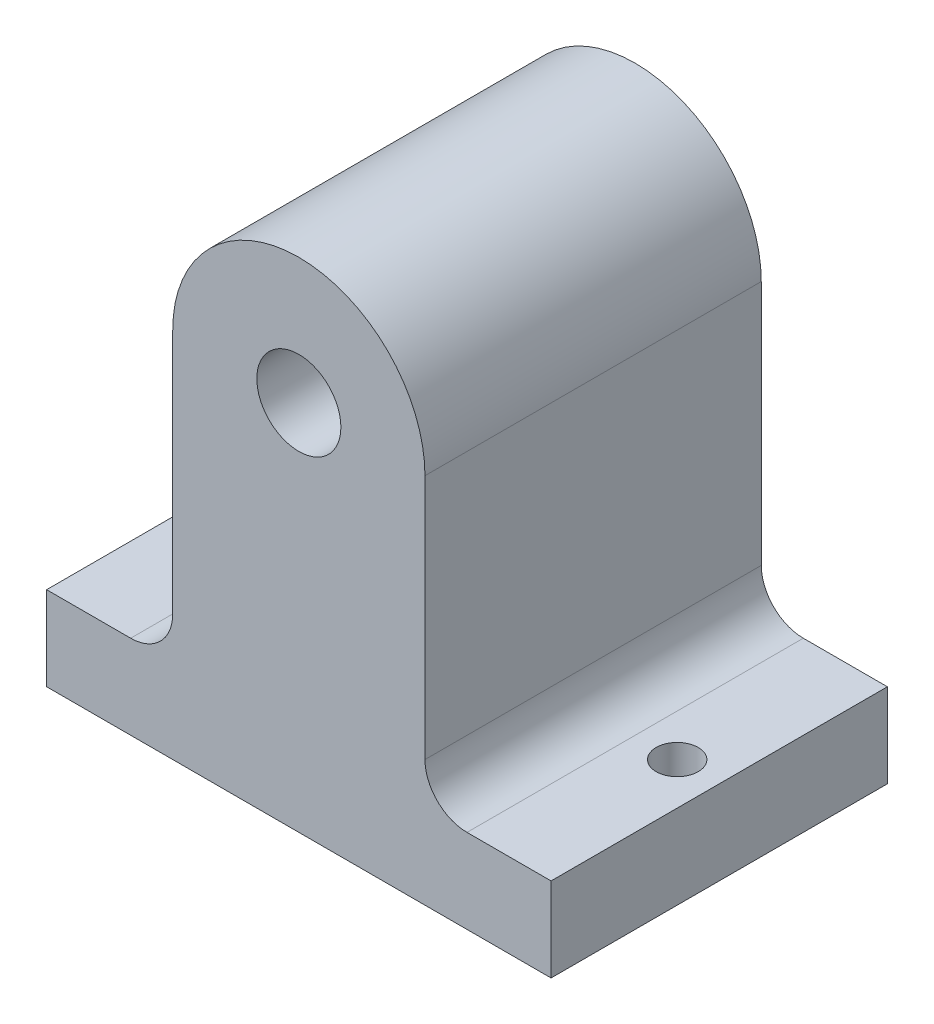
ISO-10303-21;
HEADER;
FILE_DESCRIPTION(('STEP AP214'),'2;1');
FILE_NAME('part.step','',(''),(''),'','','');
FILE_SCHEMA(('AUTOMOTIVE_DESIGN { 1 0 10303 214 1 1 1 1 }'));
ENDSEC;
DATA;
#1=APPLICATION_CONTEXT('core data for automotive mechanical design processes');
#2=APPLICATION_PROTOCOL_DEFINITION('international standard','automotive_design',2000,#1);
#3=PRODUCT_CONTEXT('',#1,'mechanical');
#4=PRODUCT('Part','Part','',(#3));
#5=PRODUCT_RELATED_PRODUCT_CATEGORY('part','',(#4));
#6=PRODUCT_DEFINITION_FORMATION('','',#4);
#7=PRODUCT_DEFINITION_CONTEXT('part definition',#1,'design');
#8=PRODUCT_DEFINITION('design','',#6,#7);
#9=PRODUCT_DEFINITION_SHAPE('','',#8);
#10=(LENGTH_UNIT() NAMED_UNIT(*) SI_UNIT(.MILLI.,.METRE.));
#11=(NAMED_UNIT(*) PLANE_ANGLE_UNIT() SI_UNIT($,.RADIAN.));
#12=(NAMED_UNIT(*) SI_UNIT($,.STERADIAN.) SOLID_ANGLE_UNIT());
#13=UNCERTAINTY_MEASURE_WITH_UNIT(LENGTH_MEASURE(1.E-05),#10,'distance_accuracy_value','');
#14=(GEOMETRIC_REPRESENTATION_CONTEXT(3) GLOBAL_UNCERTAINTY_ASSIGNED_CONTEXT((#13)) GLOBAL_UNIT_ASSIGNED_CONTEXT((#10,
#11,#12)) REPRESENTATION_CONTEXT('',''));
#15=CARTESIAN_POINT('',(0.,0.,0.));
#16=DIRECTION('',(0.,0.,1.));
#17=DIRECTION('',(1.,0.,0.));
#18=AXIS2_PLACEMENT_3D('',#15,#16,#17);
#19=CARTESIAN_POINT('',(0.,0.,25.4));
#20=DIRECTION('',(0.,0.,-1.));
#21=DIRECTION('',(-1.,0.,0.));
#22=AXIS2_PLACEMENT_3D('',#19,#20,#21);
#23=CYLINDRICAL_SURFACE('',#22,9.525);
#24=CARTESIAN_POINT('',(0.,0.,0.));
#25=DIRECTION('',(0.,0.,1.));
#26=DIRECTION('',(1.,0.,0.));
#27=AXIS2_PLACEMENT_3D('',#24,#25,#26);
#28=CIRCLE('',#27,9.525);
#29=CARTESIAN_POINT('',(9.525,0.,0.));
#30=VERTEX_POINT('',#29);
#31=CARTESIAN_POINT('',(-9.525,0.,0.));
#32=VERTEX_POINT('',#31);
#33=EDGE_CURVE('E127',#30,#32,#28,.T.);
#34=ORIENTED_EDGE('',*,*,#33,.T.);
#35=DIRECTION('',(0.,0.,-1.));
#36=VECTOR('',#35,1.);
#37=CARTESIAN_POINT('',(-9.525,0.,25.4));
#38=LINE('',#37,#36);
#39=CARTESIAN_POINT('',(-9.525,0.,25.4));
#40=VERTEX_POINT('',#39);
#41=EDGE_CURVE('E110',#40,#32,#38,.T.);
#42=ORIENTED_EDGE('',*,*,#41,.F.);
#43=CARTESIAN_POINT('',(0.,0.,25.4));
#44=DIRECTION('',(0.,0.,1.));
#45=DIRECTION('',(1.,0.,0.));
#46=AXIS2_PLACEMENT_3D('',#43,#44,#45);
#47=CIRCLE('',#46,9.525);
#48=CARTESIAN_POINT('',(9.525,0.,25.4));
#49=VERTEX_POINT('',#48);
#50=EDGE_CURVE('E115',#49,#40,#47,.T.);
#51=ORIENTED_EDGE('',*,*,#50,.F.);
#52=DIRECTION('',(0.,0.,-1.));
#53=VECTOR('',#52,1.);
#54=CARTESIAN_POINT('',(9.525,0.,25.4));
#55=LINE('',#54,#53);
#56=EDGE_CURVE('E157',#49,#30,#55,.T.);
#57=ORIENTED_EDGE('',*,*,#56,.T.);
#58=EDGE_LOOP('',(#34,#42,#51,#57));
#59=FACE_BOUND('',#58,.T.);
#60=ADVANCED_FACE('F32',(#59),#23,.T.);
#61=CARTESIAN_POINT('',(-9.525,0.,25.4));
#62=DIRECTION('',(1.,0.,0.));
#63=DIRECTION('',(0.,1.,0.));
#64=AXIS2_PLACEMENT_3D('',#61,#62,#63);
#65=PLANE('',#64);
#66=DIRECTION('',(0.,-1.,0.));
#67=VECTOR('',#66,1.);
#68=CARTESIAN_POINT('',(-9.525,0.,0.));
#69=LINE('',#68,#67);
#70=CARTESIAN_POINT('',(-9.525,-18.565900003,0.));
#71=VERTEX_POINT('',#70);
#72=EDGE_CURVE('E198',#32,#71,#69,.T.);
#73=ORIENTED_EDGE('',*,*,#72,.T.);
#74=DIRECTION('',(0.,0.,-1.));
#75=VECTOR('',#74,1.);
#76=CARTESIAN_POINT('',(-9.525,-18.565900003,25.4));
#77=LINE('',#76,#75);
#78=CARTESIAN_POINT('',(-9.525,-18.565900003,25.4));
#79=VERTEX_POINT('',#78);
#80=EDGE_CURVE('E48',#71,#79,#77,.F.);
#81=ORIENTED_EDGE('',*,*,#80,.T.);
#82=DIRECTION('',(0.,-1.,0.));
#83=VECTOR('',#82,1.);
#84=CARTESIAN_POINT('',(-9.525,0.,25.4));
#85=LINE('',#84,#83);
#86=EDGE_CURVE('E106',#40,#79,#85,.T.);
#87=ORIENTED_EDGE('',*,*,#86,.F.);
#88=ORIENTED_EDGE('',*,*,#41,.T.);
#89=EDGE_LOOP('',(#73,#81,#87,#88));
#90=FACE_BOUND('',#89,.T.);
#91=ADVANCED_FACE('F108',(#90),#65,.F.);
#92=CARTESIAN_POINT('',(0.,-21.740900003,25.4));
#93=DIRECTION('',(0.,1.,0.));
#94=DIRECTION('',(0.,0.,1.));
#95=AXIS2_PLACEMENT_3D('',#92,#93,#94);
#96=PLANE('',#95);
#97=CARTESIAN_POINT('',(-15.875,-21.740900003,12.7));
#98=DIRECTION('',(0.,1.,0.));
#99=DIRECTION('',(0.,0.,1.));
#100=AXIS2_PLACEMENT_3D('',#97,#98,#99);
#101=CIRCLE('',#100,1.5875);
#102=CARTESIAN_POINT('',(-15.875,-21.740900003,14.2875));
#103=VERTEX_POINT('',#102);
#104=EDGE_CURVE('E219',#103,#103,#101,.T.);
#105=ORIENTED_EDGE('',*,*,#104,.F.);
#106=EDGE_LOOP('',(#105));
#107=FACE_BOUND('',#106,.T.);
#108=DIRECTION('',(1.,0.,0.));
#109=VECTOR('',#108,1.);
#110=CARTESIAN_POINT('',(0.,-21.740900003,25.4));
#111=LINE('',#110,#109);
#112=CARTESIAN_POINT('',(-19.05,-21.740900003,25.4));
#113=VERTEX_POINT('',#112);
#114=CARTESIAN_POINT('',(-12.7,-21.740900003,25.4));
#115=VERTEX_POINT('',#114);
#116=EDGE_CURVE('E114',#113,#115,#111,.T.);
#117=ORIENTED_EDGE('',*,*,#116,.T.);
#118=DIRECTION('',(0.,0.,-1.));
#119=VECTOR('',#118,1.);
#120=CARTESIAN_POINT('',(-12.7,-21.740900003,25.4));
#121=LINE('',#120,#119);
#122=CARTESIAN_POINT('',(-12.7,-21.740900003,0.));
#123=VERTEX_POINT('',#122);
#124=EDGE_CURVE('E139',#115,#123,#121,.T.);
#125=ORIENTED_EDGE('',*,*,#124,.T.);
#126=DIRECTION('',(1.,0.,0.));
#127=VECTOR('',#126,1.);
#128=CARTESIAN_POINT('',(0.,-21.740900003,0.));
#129=LINE('',#128,#127);
#130=CARTESIAN_POINT('',(-19.05,-21.740900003,0.));
#131=VERTEX_POINT('',#130);
#132=EDGE_CURVE('E196',#131,#123,#129,.T.);
#133=ORIENTED_EDGE('',*,*,#132,.F.);
#134=DIRECTION('',(0.,0.,-1.));
#135=VECTOR('',#134,1.);
#136=CARTESIAN_POINT('',(-19.05,-21.740900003,25.4));
#137=LINE('',#136,#135);
#138=EDGE_CURVE('E129',#113,#131,#137,.T.);
#139=ORIENTED_EDGE('',*,*,#138,.F.);
#140=EDGE_LOOP('',(#117,#125,#133,#139));
#141=FACE_BOUND('',#140,.T.);
#142=ADVANCED_FACE('F229',(#107,#141),#96,.T.);
#143=CARTESIAN_POINT('',(-19.05,0.,25.4));
#144=DIRECTION('',(-1.,0.,0.));
#145=DIRECTION('',(0.,-1.,0.));
#146=AXIS2_PLACEMENT_3D('',#143,#144,#145);
#147=PLANE('',#146);
#148=DIRECTION('',(0.,1.,0.));
#149=VECTOR('',#148,1.);
#150=CARTESIAN_POINT('',(-19.05,0.,0.));
#151=LINE('',#150,#149);
#152=CARTESIAN_POINT('',(-19.05,-28.090900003,0.));
#153=VERTEX_POINT('',#152);
#154=EDGE_CURVE('E193',#153,#131,#151,.T.);
#155=ORIENTED_EDGE('',*,*,#154,.F.);
#156=DIRECTION('',(0.,0.,-1.));
#157=VECTOR('',#156,1.);
#158=CARTESIAN_POINT('',(-19.05,-28.090900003,25.4));
#159=LINE('',#158,#157);
#160=CARTESIAN_POINT('',(-19.05,-28.090900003,25.4));
#161=VERTEX_POINT('',#160);
#162=EDGE_CURVE('E134',#161,#153,#159,.T.);
#163=ORIENTED_EDGE('',*,*,#162,.F.);
#164=DIRECTION('',(0.,1.,0.));
#165=VECTOR('',#164,1.);
#166=CARTESIAN_POINT('',(-19.05,0.,25.4));
#167=LINE('',#166,#165);
#168=EDGE_CURVE('E210',#161,#113,#167,.T.);
#169=ORIENTED_EDGE('',*,*,#168,.T.);
#170=ORIENTED_EDGE('',*,*,#138,.T.);
#171=EDGE_LOOP('',(#155,#163,#169,#170));
#172=FACE_BOUND('',#171,.T.);
#173=ADVANCED_FACE('F194',(#172),#147,.T.);
#174=CARTESIAN_POINT('',(0.,-28.090900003,25.4));
#175=DIRECTION('',(0.,1.,0.));
#176=DIRECTION('',(0.,0.,1.));
#177=AXIS2_PLACEMENT_3D('',#174,#175,#176);
#178=PLANE('',#177);
#179=CARTESIAN_POINT('',(-15.875,-28.090900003,12.7));
#180=DIRECTION('',(0.,1.,0.));
#181=DIRECTION('',(0.,0.,1.));
#182=AXIS2_PLACEMENT_3D('',#179,#180,#181);
#183=CIRCLE('',#182,1.5875);
#184=CARTESIAN_POINT('',(-15.875,-28.090900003,14.2875));
#185=VERTEX_POINT('',#184);
#186=EDGE_CURVE('E36',#185,#185,#183,.T.);
#187=ORIENTED_EDGE('',*,*,#186,.T.);
#188=EDGE_LOOP('',(#187));
#189=FACE_BOUND('',#188,.T.);
#190=CARTESIAN_POINT('',(15.875,-28.090900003,12.7));
#191=DIRECTION('',(0.,1.,0.));
#192=DIRECTION('',(0.,0.,1.));
#193=AXIS2_PLACEMENT_3D('',#190,#191,#192);
#194=CIRCLE('',#193,1.5875);
#195=CARTESIAN_POINT('',(15.875,-28.090900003,14.2875));
#196=VERTEX_POINT('',#195);
#197=EDGE_CURVE('E216',#196,#196,#194,.T.);
#198=ORIENTED_EDGE('',*,*,#197,.T.);
#199=EDGE_LOOP('',(#198));
#200=FACE_BOUND('',#199,.T.);
#201=DIRECTION('',(1.,0.,0.));
#202=VECTOR('',#201,1.);
#203=CARTESIAN_POINT('',(0.,-28.090900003,0.));
#204=LINE('',#203,#202);
#205=CARTESIAN_POINT('',(19.05,-28.090900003,0.));
#206=VERTEX_POINT('',#205);
#207=EDGE_CURVE('E174',#153,#206,#204,.T.);
#208=ORIENTED_EDGE('',*,*,#207,.T.);
#209=DIRECTION('',(0.,0.,-1.));
#210=VECTOR('',#209,1.);
#211=CARTESIAN_POINT('',(19.05,-28.090900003,25.4));
#212=LINE('',#211,#210);
#213=CARTESIAN_POINT('',(19.05,-28.090900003,25.4));
#214=VERTEX_POINT('',#213);
#215=EDGE_CURVE('E180',#214,#206,#212,.T.);
#216=ORIENTED_EDGE('',*,*,#215,.F.);
#217=DIRECTION('',(1.,0.,0.));
#218=VECTOR('',#217,1.);
#219=CARTESIAN_POINT('',(0.,-28.090900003,25.4));
#220=LINE('',#219,#218);
#221=EDGE_CURVE('E187',#161,#214,#220,.T.);
#222=ORIENTED_EDGE('',*,*,#221,.F.);
#223=ORIENTED_EDGE('',*,*,#162,.T.);
#224=EDGE_LOOP('',(#208,#216,#222,#223));
#225=FACE_BOUND('',#224,.T.);
#226=ADVANCED_FACE('F185',(#189,#200,#225),#178,.F.);
#227=CARTESIAN_POINT('',(19.05,0.,25.4));
#228=DIRECTION('',(-1.,0.,0.));
#229=DIRECTION('',(0.,-1.,0.));
#230=AXIS2_PLACEMENT_3D('',#227,#228,#229);
#231=PLANE('',#230);
#232=DIRECTION('',(0.,1.,0.));
#233=VECTOR('',#232,1.);
#234=CARTESIAN_POINT('',(19.05,0.,0.));
#235=LINE('',#234,#233);
#236=CARTESIAN_POINT('',(19.05,-21.740900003,0.));
#237=VERTEX_POINT('',#236);
#238=EDGE_CURVE('E171',#206,#237,#235,.T.);
#239=ORIENTED_EDGE('',*,*,#238,.T.);
#240=DIRECTION('',(0.,0.,-1.));
#241=VECTOR('',#240,1.);
#242=CARTESIAN_POINT('',(19.05,-21.740900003,25.4));
#243=LINE('',#242,#241);
#244=CARTESIAN_POINT('',(19.05,-21.740900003,25.4));
#245=VERTEX_POINT('',#244);
#246=EDGE_CURVE('E169',#245,#237,#243,.T.);
#247=ORIENTED_EDGE('',*,*,#246,.F.);
#248=DIRECTION('',(0.,1.,0.));
#249=VECTOR('',#248,1.);
#250=CARTESIAN_POINT('',(19.05,0.,25.4));
#251=LINE('',#250,#249);
#252=EDGE_CURVE('E207',#214,#245,#251,.T.);
#253=ORIENTED_EDGE('',*,*,#252,.F.);
#254=ORIENTED_EDGE('',*,*,#215,.T.);
#255=EDGE_LOOP('',(#239,#247,#253,#254));
#256=FACE_BOUND('',#255,.T.);
#257=ADVANCED_FACE('F259',(#256),#231,.F.);
#258=CARTESIAN_POINT('',(0.,-21.740900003,25.4));
#259=DIRECTION('',(0.,1.,0.));
#260=DIRECTION('',(0.,0.,1.));
#261=AXIS2_PLACEMENT_3D('',#258,#259,#260);
#262=PLANE('',#261);
#263=CARTESIAN_POINT('',(15.875,-21.740900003,12.7));
#264=DIRECTION('',(0.,1.,0.));
#265=DIRECTION('',(0.,0.,1.));
#266=AXIS2_PLACEMENT_3D('',#263,#264,#265);
#267=CIRCLE('',#266,1.5875);
#268=CARTESIAN_POINT('',(15.875,-21.740900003,14.2875));
#269=VERTEX_POINT('',#268);
#270=EDGE_CURVE('E220',#269,#269,#267,.T.);
#271=ORIENTED_EDGE('',*,*,#270,.F.);
#272=EDGE_LOOP('',(#271));
#273=FACE_BOUND('',#272,.T.);
#274=DIRECTION('',(1.,0.,0.));
#275=VECTOR('',#274,1.);
#276=CARTESIAN_POINT('',(0.,-21.740900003,0.));
#277=LINE('',#276,#275);
#278=CARTESIAN_POINT('',(12.7,-21.740900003,0.));
#279=VERTEX_POINT('',#278);
#280=EDGE_CURVE('E163',#279,#237,#277,.T.);
#281=ORIENTED_EDGE('',*,*,#280,.F.);
#282=DIRECTION('',(0.,0.,-1.));
#283=VECTOR('',#282,1.);
#284=CARTESIAN_POINT('',(12.7,-21.740900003,25.4));
#285=LINE('',#284,#283);
#286=CARTESIAN_POINT('',(12.7,-21.740900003,25.4));
#287=VERTEX_POINT('',#286);
#288=EDGE_CURVE('E132',#279,#287,#285,.F.);
#289=ORIENTED_EDGE('',*,*,#288,.T.);
#290=DIRECTION('',(1.,0.,0.));
#291=VECTOR('',#290,1.);
#292=CARTESIAN_POINT('',(0.,-21.740900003,25.4));
#293=LINE('',#292,#291);
#294=EDGE_CURVE('E150',#287,#245,#293,.T.);
#295=ORIENTED_EDGE('',*,*,#294,.T.);
#296=ORIENTED_EDGE('',*,*,#246,.T.);
#297=EDGE_LOOP('',(#281,#289,#295,#296));
#298=FACE_BOUND('',#297,.T.);
#299=ADVANCED_FACE('F167',(#273,#298),#262,.T.);
#300=CARTESIAN_POINT('',(0.,0.,25.4));
#301=DIRECTION('',(0.,0.,-1.));
#302=DIRECTION('',(-1.,0.,0.));
#303=AXIS2_PLACEMENT_3D('',#300,#301,#302);
#304=CYLINDRICAL_SURFACE('',#303,3.175);
#305=CARTESIAN_POINT('',(0.,0.,25.4));
#306=DIRECTION('',(0.,0.,1.));
#307=DIRECTION('',(1.,0.,0.));
#308=AXIS2_PLACEMENT_3D('',#305,#306,#307);
#309=CIRCLE('',#308,3.175);
#310=CARTESIAN_POINT('',(3.175,0.,25.4));
#311=VERTEX_POINT('',#310);
#312=EDGE_CURVE('E124',#311,#311,#309,.T.);
#313=ORIENTED_EDGE('',*,*,#312,.T.);
#314=EDGE_LOOP('',(#313));
#315=FACE_BOUND('',#314,.T.);
#316=CARTESIAN_POINT('',(0.,0.,0.));
#317=DIRECTION('',(0.,0.,1.));
#318=DIRECTION('',(1.,0.,0.));
#319=AXIS2_PLACEMENT_3D('',#316,#317,#318);
#320=CIRCLE('',#319,3.175);
#321=CARTESIAN_POINT('',(3.175,0.,0.));
#322=VERTEX_POINT('',#321);
#323=EDGE_CURVE('E203',#322,#322,#320,.T.);
#324=ORIENTED_EDGE('',*,*,#323,.F.);
#325=EDGE_LOOP('',(#324));
#326=FACE_BOUND('',#325,.T.);
#327=ADVANCED_FACE('F251',(#315,#326),#304,.F.);
#328=CARTESIAN_POINT('',(9.525,0.,25.4));
#329=DIRECTION('',(-1.,0.,0.));
#330=DIRECTION('',(0.,-1.,0.));
#331=AXIS2_PLACEMENT_3D('',#328,#329,#330);
#332=PLANE('',#331);
#333=DIRECTION('',(0.,1.,0.));
#334=VECTOR('',#333,1.);
#335=CARTESIAN_POINT('',(9.525,0.,25.4));
#336=LINE('',#335,#334);
#337=CARTESIAN_POINT('',(9.525,-18.565900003,25.4));
#338=VERTEX_POINT('',#337);
#339=EDGE_CURVE('E120',#338,#49,#336,.T.);
#340=ORIENTED_EDGE('',*,*,#339,.F.);
#341=DIRECTION('',(0.,0.,-1.));
#342=VECTOR('',#341,1.);
#343=CARTESIAN_POINT('',(9.525,-18.565900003,25.4));
#344=LINE('',#343,#342);
#345=CARTESIAN_POINT('',(9.525,-18.565900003,0.));
#346=VERTEX_POINT('',#345);
#347=EDGE_CURVE('E128',#338,#346,#344,.T.);
#348=ORIENTED_EDGE('',*,*,#347,.T.);
#349=DIRECTION('',(0.,1.,0.));
#350=VECTOR('',#349,1.);
#351=CARTESIAN_POINT('',(9.525,0.,0.));
#352=LINE('',#351,#350);
#353=EDGE_CURVE('E165',#346,#30,#352,.T.);
#354=ORIENTED_EDGE('',*,*,#353,.T.);
#355=ORIENTED_EDGE('',*,*,#56,.F.);
#356=EDGE_LOOP('',(#340,#348,#354,#355));
#357=FACE_BOUND('',#356,.T.);
#358=ADVANCED_FACE('F155',(#357),#332,.F.);
#359=CARTESIAN_POINT('',(0.,0.,25.4));
#360=DIRECTION('',(0.,0.,1.));
#361=DIRECTION('',(1.,0.,0.));
#362=AXIS2_PLACEMENT_3D('',#359,#360,#361);
#363=PLANE('',#362);
#364=ORIENTED_EDGE('',*,*,#312,.F.);
#365=EDGE_LOOP('',(#364));
#366=FACE_BOUND('',#365,.T.);
#367=ORIENTED_EDGE('',*,*,#50,.T.);
#368=ORIENTED_EDGE('',*,*,#86,.T.);
#369=CARTESIAN_POINT('',(-12.7,-18.565900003,25.4));
#370=DIRECTION('',(0.,0.,1.));
#371=DIRECTION('',(1.,0.,0.));
#372=AXIS2_PLACEMENT_3D('',#369,#370,#371);
#373=CIRCLE('',#372,3.175);
#374=EDGE_CURVE('E11',#79,#115,#373,.F.);
#375=ORIENTED_EDGE('',*,*,#374,.T.);
#376=ORIENTED_EDGE('',*,*,#116,.F.);
#377=ORIENTED_EDGE('',*,*,#168,.F.);
#378=ORIENTED_EDGE('',*,*,#221,.T.);
#379=ORIENTED_EDGE('',*,*,#252,.T.);
#380=ORIENTED_EDGE('',*,*,#294,.F.);
#381=CARTESIAN_POINT('',(12.7,-18.565900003,25.4));
#382=DIRECTION('',(0.,0.,1.));
#383=DIRECTION('',(1.,0.,0.));
#384=AXIS2_PLACEMENT_3D('',#381,#382,#383);
#385=CIRCLE('',#384,3.175);
#386=EDGE_CURVE('E145',#287,#338,#385,.F.);
#387=ORIENTED_EDGE('',*,*,#386,.T.);
#388=ORIENTED_EDGE('',*,*,#339,.T.);
#389=EDGE_LOOP('',(#367,#368,#375,#376,#377,#378,#379,#380,#387,#388));
#390=FACE_BOUND('',#389,.T.);
#391=ADVANCED_FACE('F118',(#366,#390),#363,.T.);
#392=CARTESIAN_POINT('',(0.,0.,0.));
#393=DIRECTION('',(0.,0.,1.));
#394=DIRECTION('',(1.,0.,0.));
#395=AXIS2_PLACEMENT_3D('',#392,#393,#394);
#396=PLANE('',#395);
#397=ORIENTED_EDGE('',*,*,#323,.T.);
#398=EDGE_LOOP('',(#397));
#399=FACE_BOUND('',#398,.T.);
#400=ORIENTED_EDGE('',*,*,#33,.F.);
#401=ORIENTED_EDGE('',*,*,#353,.F.);
#402=CARTESIAN_POINT('',(12.7,-18.565900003,0.));
#403=DIRECTION('',(0.,0.,1.));
#404=DIRECTION('',(1.,0.,0.));
#405=AXIS2_PLACEMENT_3D('',#402,#403,#404);
#406=CIRCLE('',#405,3.175);
#407=EDGE_CURVE('E143',#346,#279,#406,.T.);
#408=ORIENTED_EDGE('',*,*,#407,.T.);
#409=ORIENTED_EDGE('',*,*,#280,.T.);
#410=ORIENTED_EDGE('',*,*,#238,.F.);
#411=ORIENTED_EDGE('',*,*,#207,.F.);
#412=ORIENTED_EDGE('',*,*,#154,.T.);
#413=ORIENTED_EDGE('',*,*,#132,.T.);
#414=CARTESIAN_POINT('',(-12.7,-18.565900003,0.));
#415=DIRECTION('',(0.,0.,1.));
#416=DIRECTION('',(1.,0.,0.));
#417=AXIS2_PLACEMENT_3D('',#414,#415,#416);
#418=CIRCLE('',#417,3.175);
#419=EDGE_CURVE('E41',#123,#71,#418,.T.);
#420=ORIENTED_EDGE('',*,*,#419,.T.);
#421=ORIENTED_EDGE('',*,*,#72,.F.);
#422=EDGE_LOOP('',(#400,#401,#408,#409,#410,#411,#412,#413,#420,#421));
#423=FACE_BOUND('',#422,.T.);
#424=ADVANCED_FACE('F161',(#399,#423),#396,.F.);
#425=CARTESIAN_POINT('',(12.7,-18.565900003,25.4));
#426=DIRECTION('',(0.,0.,-1.));
#427=DIRECTION('',(-1.,0.,0.));
#428=AXIS2_PLACEMENT_3D('',#425,#426,#427);
#429=CYLINDRICAL_SURFACE('',#428,3.175);
#430=ORIENTED_EDGE('',*,*,#386,.F.);
#431=ORIENTED_EDGE('',*,*,#288,.F.);
#432=ORIENTED_EDGE('',*,*,#407,.F.);
#433=ORIENTED_EDGE('',*,*,#347,.F.);
#434=EDGE_LOOP('',(#430,#431,#432,#433));
#435=FACE_BOUND('',#434,.T.);
#436=ADVANCED_FACE('F159',(#435),#429,.F.);
#437=CARTESIAN_POINT('',(-12.7,-18.565900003,25.4));
#438=DIRECTION('',(0.,0.,-1.));
#439=DIRECTION('',(-1.,0.,0.));
#440=AXIS2_PLACEMENT_3D('',#437,#438,#439);
#441=CYLINDRICAL_SURFACE('',#440,3.175);
#442=ORIENTED_EDGE('',*,*,#374,.F.);
#443=ORIENTED_EDGE('',*,*,#80,.F.);
#444=ORIENTED_EDGE('',*,*,#419,.F.);
#445=ORIENTED_EDGE('',*,*,#124,.F.);
#446=EDGE_LOOP('',(#442,#443,#444,#445));
#447=FACE_BOUND('',#446,.T.);
#448=ADVANCED_FACE('F34',(#447),#441,.F.);
#449=CARTESIAN_POINT('',(15.875,-47.140900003,12.7));
#450=DIRECTION('',(0.,1.,0.));
#451=DIRECTION('',(0.,0.,1.));
#452=AXIS2_PLACEMENT_3D('',#449,#450,#451);
#453=CYLINDRICAL_SURFACE('',#452,1.5875);
#454=ORIENTED_EDGE('',*,*,#270,.T.);
#455=EDGE_LOOP('',(#454));
#456=FACE_BOUND('',#455,.T.);
#457=ORIENTED_EDGE('',*,*,#197,.F.);
#458=EDGE_LOOP('',(#457));
#459=FACE_BOUND('',#458,.T.);
#460=ADVANCED_FACE('F237',(#456,#459),#453,.F.);
#461=CARTESIAN_POINT('',(-15.875,-47.140900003,12.7));
#462=DIRECTION('',(0.,1.,0.));
#463=DIRECTION('',(0.,0.,1.));
#464=AXIS2_PLACEMENT_3D('',#461,#462,#463);
#465=CYLINDRICAL_SURFACE('',#464,1.5875);
#466=ORIENTED_EDGE('',*,*,#104,.T.);
#467=EDGE_LOOP('',(#466));
#468=FACE_BOUND('',#467,.T.);
#469=ORIENTED_EDGE('',*,*,#186,.F.);
#470=EDGE_LOOP('',(#469));
#471=FACE_BOUND('',#470,.T.);
#472=ADVANCED_FACE('F226',(#468,#471),#465,.F.);
#473=CLOSED_SHELL('',(#60,#91,#142,#173,#226,#257,#299,#327,#358,#391,#424,#436,#448,#460,#472));
#474=MANIFOLD_SOLID_BREP('B2',#473);
#475=ADVANCED_BREP_SHAPE_REPRESENTATION('',(#18,#474),#14);
#476=SHAPE_DEFINITION_REPRESENTATION(#9,#475);
ENDSEC;
END-ISO-10303-21;
